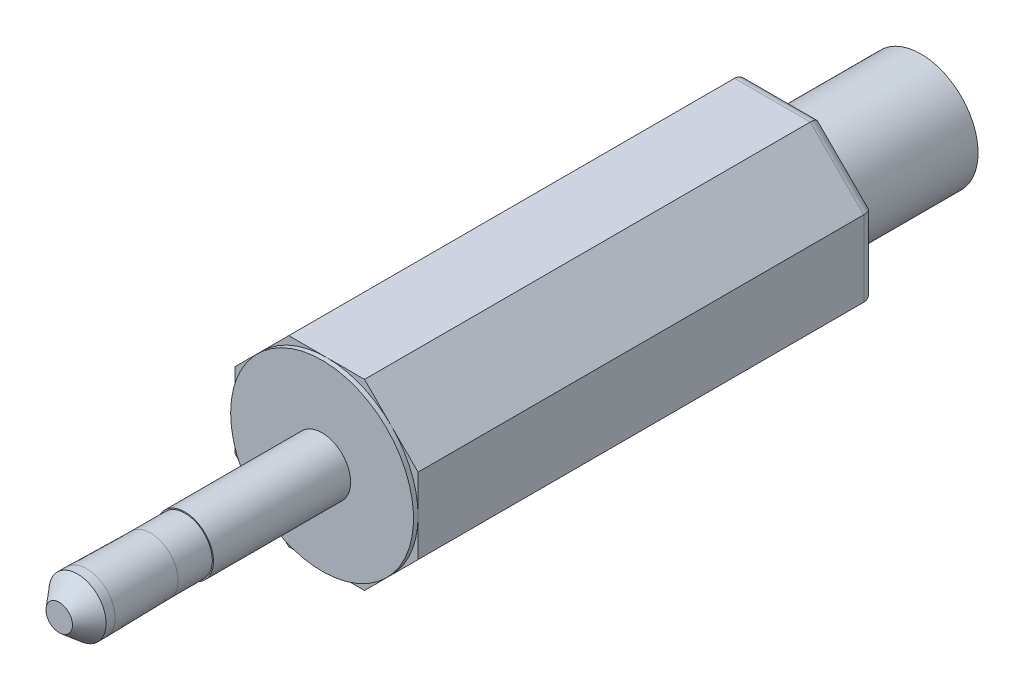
ISO-10303-21;
HEADER;
FILE_DESCRIPTION(('STEP AP214'),'2;1');
FILE_NAME('part.step','',(''),(''),'','','');
FILE_SCHEMA(('AUTOMOTIVE_DESIGN { 1 0 10303 214 1 1 1 1 }'));
ENDSEC;
DATA;
#1=APPLICATION_CONTEXT('core data for automotive mechanical design processes');
#2=APPLICATION_PROTOCOL_DEFINITION('international standard','automotive_design',2000,#1);
#3=PRODUCT_CONTEXT('',#1,'mechanical');
#4=PRODUCT('Part','Part','',(#3));
#5=PRODUCT_RELATED_PRODUCT_CATEGORY('part','',(#4));
#6=PRODUCT_DEFINITION_FORMATION('','',#4);
#7=PRODUCT_DEFINITION_CONTEXT('part definition',#1,'design');
#8=PRODUCT_DEFINITION('design','',#6,#7);
#9=PRODUCT_DEFINITION_SHAPE('','',#8);
#10=(LENGTH_UNIT() NAMED_UNIT(*) SI_UNIT(.MILLI.,.METRE.));
#11=(NAMED_UNIT(*) PLANE_ANGLE_UNIT() SI_UNIT($,.RADIAN.));
#12=(NAMED_UNIT(*) SI_UNIT($,.STERADIAN.) SOLID_ANGLE_UNIT());
#13=UNCERTAINTY_MEASURE_WITH_UNIT(LENGTH_MEASURE(1.E-05),#10,'distance_accuracy_value','');
#14=(GEOMETRIC_REPRESENTATION_CONTEXT(3) GLOBAL_UNCERTAINTY_ASSIGNED_CONTEXT((#13)) GLOBAL_UNIT_ASSIGNED_CONTEXT((#10,
#11,#12)) REPRESENTATION_CONTEXT('',''));
#15=CARTESIAN_POINT('',(0.,0.,0.));
#16=DIRECTION('',(0.,0.,1.));
#17=DIRECTION('',(1.,0.,0.));
#18=AXIS2_PLACEMENT_3D('',#15,#16,#17);
#19=CARTESIAN_POINT('',(-5.65685424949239,0.,-20.2));
#20=DIRECTION('',(0.,0.,-1.));
#21=DIRECTION('',(-1.,0.,0.));
#22=AXIS2_PLACEMENT_3D('',#19,#20,#21);
#23=PLANE('',#22);
#24=DIRECTION('',(1.,0.,0.));
#25=VECTOR('',#24,1.);
#26=CARTESIAN_POINT('',(1.65685424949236,3.50000000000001,-20.2));
#27=LINE('',#26,#25);
#28=CARTESIAN_POINT('',(-1.44974746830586,3.49999999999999,-20.2));
#29=VERTEX_POINT('',#28);
#30=CARTESIAN_POINT('',(1.44974746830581,3.50000000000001,-20.2));
#31=VERTEX_POINT('',#30);
#32=EDGE_CURVE('E470',#29,#31,#27,.T.);
#33=ORIENTED_EDGE('',*,*,#32,.T.);
#34=DIRECTION('',(0.707106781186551,-0.707106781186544,0.));
#35=VECTOR('',#34,1.);
#36=CARTESIAN_POINT('',(3.64644660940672,1.30330085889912,-20.2));
#37=LINE('',#36,#35);
#38=CARTESIAN_POINT('',(3.49999999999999,1.44974746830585,-20.2));
#39=VERTEX_POINT('',#38);
#40=EDGE_CURVE('E472',#31,#39,#37,.T.);
#41=ORIENTED_EDGE('',*,*,#40,.T.);
#42=DIRECTION('',(0.,-1.,0.));
#43=VECTOR('',#42,1.);
#44=CARTESIAN_POINT('',(3.50000000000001,-1.65685424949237,-20.2));
#45=LINE('',#44,#43);
#46=CARTESIAN_POINT('',(3.5,-1.44974746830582,-20.2));
#47=VERTEX_POINT('',#46);
#48=EDGE_CURVE('E466',#39,#47,#45,.T.);
#49=ORIENTED_EDGE('',*,*,#48,.T.);
#50=DIRECTION('',(-0.707106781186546,-0.707106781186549,0.));
#51=VECTOR('',#50,1.);
#52=CARTESIAN_POINT('',(1.30330085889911,-3.64644660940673,-20.2));
#53=LINE('',#52,#51);
#54=CARTESIAN_POINT('',(1.44974746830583,-3.5,-20.2));
#55=VERTEX_POINT('',#54);
#56=EDGE_CURVE('E464',#47,#55,#53,.T.);
#57=ORIENTED_EDGE('',*,*,#56,.T.);
#58=DIRECTION('',(-1.,0.,0.));
#59=VECTOR('',#58,1.);
#60=CARTESIAN_POINT('',(-1.65685424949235,-3.5,-20.2));
#61=LINE('',#60,#59);
#62=CARTESIAN_POINT('',(-1.44974746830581,-3.5,-20.2));
#63=VERTEX_POINT('',#62);
#64=EDGE_CURVE('E462',#55,#63,#61,.T.);
#65=ORIENTED_EDGE('',*,*,#64,.T.);
#66=DIRECTION('',(-0.707106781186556,0.707106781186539,0.));
#67=VECTOR('',#66,1.);
#68=CARTESIAN_POINT('',(-3.64644660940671,-1.30330085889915,-20.2));
#69=LINE('',#68,#67);
#70=CARTESIAN_POINT('',(-3.49999999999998,-1.44974746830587,-20.2));
#71=VERTEX_POINT('',#70);
#72=EDGE_CURVE('E460',#63,#71,#69,.T.);
#73=ORIENTED_EDGE('',*,*,#72,.T.);
#74=DIRECTION('',(0.,1.,0.));
#75=VECTOR('',#74,1.);
#76=CARTESIAN_POINT('',(-3.50000000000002,1.65685424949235,-20.2));
#77=LINE('',#76,#75);
#78=CARTESIAN_POINT('',(-3.50000000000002,1.4497474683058,-20.2));
#79=VERTEX_POINT('',#78);
#80=EDGE_CURVE('E458',#71,#79,#77,.T.);
#81=ORIENTED_EDGE('',*,*,#80,.T.);
#82=DIRECTION('',(0.707106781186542,0.707106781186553,0.));
#83=VECTOR('',#82,1.);
#84=CARTESIAN_POINT('',(-1.30330085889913,3.64644660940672,-20.2));
#85=LINE('',#84,#83);
#86=EDGE_CURVE('E468',#79,#29,#85,.T.);
#87=ORIENTED_EDGE('',*,*,#86,.T.);
#88=EDGE_LOOP('',(#33,#41,#49,#57,#65,#73,#81,#87));
#89=FACE_BOUND('',#88,.T.);
#90=CARTESIAN_POINT('',(0.,0.,-20.2));
#91=DIRECTION('',(0.,0.,-1.));
#92=DIRECTION('',(-1.,0.,0.));
#93=AXIS2_PLACEMENT_3D('',#90,#91,#92);
#94=CIRCLE('',#93,2.5);
#95=CARTESIAN_POINT('',(-2.5,0.,-20.2));
#96=VERTEX_POINT('',#95);
#97=EDGE_CURVE('E321',#96,#96,#94,.T.);
#98=ORIENTED_EDGE('',*,*,#97,.F.);
#99=EDGE_LOOP('',(#98));
#100=FACE_BOUND('',#99,.T.);
#101=ADVANCED_FACE('F30',(#89,#100),#23,.T.);
#102=CARTESIAN_POINT('',(0.,0.,6.));
#103=DIRECTION('',(0.,0.,1.));
#104=DIRECTION('',(1.,0.,0.));
#105=AXIS2_PLACEMENT_3D('',#102,#103,#104);
#106=PLANE('',#105);
#107=CARTESIAN_POINT('',(0.,0.,6.));
#108=DIRECTION('',(0.,0.,1.));
#109=DIRECTION('',(1.,0.,0.));
#110=AXIS2_PLACEMENT_3D('',#107,#108,#109);
#111=CIRCLE('',#110,1.25);
#112=CARTESIAN_POINT('',(1.25,0.,6.));
#113=VERTEX_POINT('',#112);
#114=EDGE_CURVE('E441',#113,#113,#111,.T.);
#115=ORIENTED_EDGE('',*,*,#114,.T.);
#116=EDGE_LOOP('',(#115));
#117=FACE_BOUND('',#116,.T.);
#118=CARTESIAN_POINT('',(0.,0.,6.));
#119=DIRECTION('',(0.,0.,1.));
#120=DIRECTION('',(1.,0.,0.));
#121=AXIS2_PLACEMENT_3D('',#118,#119,#120);
#122=CIRCLE('',#121,1.2);
#123=CARTESIAN_POINT('',(1.2,0.,6.));
#124=VERTEX_POINT('',#123);
#125=EDGE_CURVE('E437',#124,#124,#122,.T.);
#126=ORIENTED_EDGE('',*,*,#125,.F.);
#127=EDGE_LOOP('',(#126));
#128=FACE_BOUND('',#127,.T.);
#129=ADVANCED_FACE('F602',(#117,#128),#106,.T.);
#130=CARTESIAN_POINT('',(0.,0.,6.));
#131=DIRECTION('',(0.,0.,-1.));
#132=DIRECTION('',(-1.,0.,0.));
#133=AXIS2_PLACEMENT_3D('',#130,#131,#132);
#134=CYLINDRICAL_SURFACE('',#133,1.25);
#135=ORIENTED_EDGE('',*,*,#114,.F.);
#136=EDGE_LOOP('',(#135));
#137=FACE_BOUND('',#136,.T.);
#138=CARTESIAN_POINT('',(0.,0.,0.));
#139=DIRECTION('',(0.,0.,-1.));
#140=DIRECTION('',(-1.,0.,0.));
#141=AXIS2_PLACEMENT_3D('',#138,#139,#140);
#142=CIRCLE('',#141,1.25);
#143=CARTESIAN_POINT('',(-1.25,0.,0.));
#144=VERTEX_POINT('',#143);
#145=EDGE_CURVE('E431',#144,#144,#142,.T.);
#146=ORIENTED_EDGE('',*,*,#145,.F.);
#147=EDGE_LOOP('',(#146));
#148=FACE_BOUND('',#147,.T.);
#149=ADVANCED_FACE('F607',(#137,#148),#134,.T.);
#150=CARTESIAN_POINT('',(0.,0.,7.5));
#151=DIRECTION('',(0.,0.,-1.));
#152=DIRECTION('',(-1.,0.,0.));
#153=AXIS2_PLACEMENT_3D('',#150,#151,#152);
#154=CYLINDRICAL_SURFACE('',#153,1.2);
#155=CARTESIAN_POINT('',(0.,0.,7.5));
#156=DIRECTION('',(0.,0.,1.));
#157=DIRECTION('',(1.,0.,0.));
#158=AXIS2_PLACEMENT_3D('',#155,#156,#157);
#159=CIRCLE('',#158,1.2);
#160=CARTESIAN_POINT('',(1.2,0.,7.5));
#161=VERTEX_POINT('',#160);
#162=EDGE_CURVE('E438',#161,#161,#159,.T.);
#163=ORIENTED_EDGE('',*,*,#162,.F.);
#164=EDGE_LOOP('',(#163));
#165=FACE_BOUND('',#164,.T.);
#166=ORIENTED_EDGE('',*,*,#125,.T.);
#167=EDGE_LOOP('',(#166));
#168=FACE_BOUND('',#167,.T.);
#169=ADVANCED_FACE('F653',(#165,#168),#154,.T.);
#170=CARTESIAN_POINT('',(0.,0.,7.5));
#171=DIRECTION('',(0.,0.,1.));
#172=DIRECTION('',(1.,0.,0.));
#173=AXIS2_PLACEMENT_3D('',#170,#171,#172);
#174=PLANE('',#173);
#175=CARTESIAN_POINT('',(0.,0.,7.5));
#176=DIRECTION('',(0.,0.,1.));
#177=DIRECTION('',(1.,0.,0.));
#178=AXIS2_PLACEMENT_3D('',#175,#176,#177);
#179=CIRCLE('',#178,1.20112581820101);
#180=CARTESIAN_POINT('',(1.20112581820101,0.,7.5));
#181=VERTEX_POINT('',#180);
#182=EDGE_CURVE('E449',#181,#181,#179,.F.);
#183=ORIENTED_EDGE('',*,*,#182,.T.);
#184=EDGE_LOOP('',(#183));
#185=FACE_BOUND('',#184,.T.);
#186=ORIENTED_EDGE('',*,*,#162,.T.);
#187=EDGE_LOOP('',(#186));
#188=FACE_BOUND('',#187,.T.);
#189=ADVANCED_FACE('F650',(#185,#188),#174,.F.);
#190=CARTESIAN_POINT('',(0.,0.,11.5));
#191=DIRECTION('',(0.,0.,-1.));
#192=DIRECTION('',(-1.,0.,0.));
#193=AXIS2_PLACEMENT_3D('',#190,#191,#192);
#194=CYLINDRICAL_SURFACE('',#193,1.25);
#195=CARTESIAN_POINT('',(0.,0.,10.7));
#196=DIRECTION('',(0.,0.,1.));
#197=DIRECTION('',(1.,0.,0.));
#198=AXIS2_PLACEMENT_3D('',#195,#196,#197);
#199=CIRCLE('',#198,1.25);
#200=CARTESIAN_POINT('',(1.25,0.,10.7));
#201=VERTEX_POINT('',#200);
#202=EDGE_CURVE('E455',#201,#201,#199,.F.);
#203=ORIENTED_EDGE('',*,*,#202,.T.);
#204=EDGE_LOOP('',(#203));
#205=FACE_BOUND('',#204,.T.);
#206=CARTESIAN_POINT('',(0.,0.,10.2999999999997));
#207=DIRECTION('',(0.,0.,1.));
#208=DIRECTION('',(1.,0.,0.));
#209=AXIS2_PLACEMENT_3D('',#206,#207,#208);
#210=CIRCLE('',#209,1.25);
#211=CARTESIAN_POINT('',(1.25,0.,10.2999999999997));
#212=VERTEX_POINT('',#211);
#213=EDGE_CURVE('E446',#212,#212,#210,.T.);
#214=ORIENTED_EDGE('',*,*,#213,.T.);
#215=EDGE_LOOP('',(#214));
#216=FACE_BOUND('',#215,.T.);
#217=ADVANCED_FACE('F648',(#205,#216),#194,.T.);
#218=CARTESIAN_POINT('',(0.,0.,11.5));
#219=DIRECTION('',(0.,0.,1.));
#220=DIRECTION('',(1.,0.,0.));
#221=AXIS2_PLACEMENT_3D('',#218,#219,#220);
#222=PLANE('',#221);
#223=CARTESIAN_POINT('',(0.,0.,11.5));
#224=DIRECTION('',(0.,0.,1.));
#225=DIRECTION('',(1.,0.,0.));
#226=AXIS2_PLACEMENT_3D('',#223,#224,#225);
#227=CIRCLE('',#226,0.578720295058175);
#228=CARTESIAN_POINT('',(0.578720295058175,0.,11.5));
#229=VERTEX_POINT('',#228);
#230=EDGE_CURVE('E452',#229,#229,#227,.T.);
#231=ORIENTED_EDGE('',*,*,#230,.T.);
#232=EDGE_LOOP('',(#231));
#233=FACE_BOUND('',#232,.T.);
#234=ADVANCED_FACE('F644',(#233),#222,.T.);
#235=CARTESIAN_POINT('',(0.,0.,10.2999999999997));
#236=DIRECTION('',(0.,0.,1.));
#237=DIRECTION('',(1.,0.,0.));
#238=AXIS2_PLACEMENT_3D('',#235,#236,#237);
#239=CONICAL_SURFACE('',#238,1.25,0.0174532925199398);
#240=ORIENTED_EDGE('',*,*,#182,.F.);
#241=EDGE_LOOP('',(#240));
#242=FACE_BOUND('',#241,.T.);
#243=ORIENTED_EDGE('',*,*,#213,.F.);
#244=EDGE_LOOP('',(#243));
#245=FACE_BOUND('',#244,.T.);
#246=ADVANCED_FACE('F647',(#242,#245),#239,.T.);
#247=CARTESIAN_POINT('',(0.,0.,11.5));
#248=DIRECTION('',(0.,0.,-1.));
#249=DIRECTION('',(-1.,0.,0.));
#250=AXIS2_PLACEMENT_3D('',#247,#248,#249);
#251=CONICAL_SURFACE('',#250,0.578720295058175,0.69813170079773);
#252=ORIENTED_EDGE('',*,*,#202,.F.);
#253=EDGE_LOOP('',(#252));
#254=FACE_BOUND('',#253,.T.);
#255=ORIENTED_EDGE('',*,*,#230,.F.);
#256=EDGE_LOOP('',(#255));
#257=FACE_BOUND('',#256,.T.);
#258=ADVANCED_FACE('F639',(#254,#257),#251,.T.);
#259=CARTESIAN_POINT('',(0.,0.,0.));
#260=DIRECTION('',(0.,0.,-1.));
#261=DIRECTION('',(-1.,0.,0.));
#262=AXIS2_PLACEMENT_3D('',#259,#260,#261);
#263=PLANE('',#262);
#264=CARTESIAN_POINT('',(0.,0.,0.));
#265=DIRECTION('',(0.,0.,-1.));
#266=DIRECTION('',(-1.,0.,0.));
#267=AXIS2_PLACEMENT_3D('',#264,#265,#266);
#268=CIRCLE('',#267,4.);
#269=CARTESIAN_POINT('',(-4.,0.,0.));
#270=VERTEX_POINT('',#269);
#271=EDGE_CURVE('E432',#270,#270,#268,.T.);
#272=ORIENTED_EDGE('',*,*,#271,.F.);
#273=EDGE_LOOP('',(#272));
#274=FACE_BOUND('',#273,.T.);
#275=ORIENTED_EDGE('',*,*,#145,.T.);
#276=EDGE_LOOP('',(#275));
#277=FACE_BOUND('',#276,.T.);
#278=ADVANCED_FACE('F636',(#274,#277),#263,.F.);
#279=CARTESIAN_POINT('',(0.,0.,-0.2));
#280=DIRECTION('',(0.,0.,1.));
#281=DIRECTION('',(1.,0.,0.));
#282=AXIS2_PLACEMENT_3D('',#279,#280,#281);
#283=CYLINDRICAL_SURFACE('',#282,4.);
#284=CARTESIAN_POINT('',(0.,0.,-0.2));
#285=DIRECTION('',(0.,0.,-1.));
#286=DIRECTION('',(-1.,0.,0.));
#287=AXIS2_PLACEMENT_3D('',#284,#285,#286);
#288=CIRCLE('',#287,4.);
#289=CARTESIAN_POINT('',(-4.,0.,-0.2));
#290=VERTEX_POINT('',#289);
#291=CARTESIAN_POINT('',(-2.82842712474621,2.82842712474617,-0.2));
#292=VERTEX_POINT('',#291);
#293=EDGE_CURVE('E428',#290,#292,#288,.T.);
#294=ORIENTED_EDGE('',*,*,#293,.F.);
#295=CARTESIAN_POINT('',(0.,0.,-0.2));
#296=DIRECTION('',(0.,0.,-1.));
#297=DIRECTION('',(-1.,0.,0.));
#298=AXIS2_PLACEMENT_3D('',#295,#296,#297);
#299=CIRCLE('',#298,4.);
#300=CARTESIAN_POINT('',(-2.82842712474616,-2.82842712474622,-0.2));
#301=VERTEX_POINT('',#300);
#302=EDGE_CURVE('E423',#301,#290,#299,.T.);
#303=ORIENTED_EDGE('',*,*,#302,.F.);
#304=CARTESIAN_POINT('',(0.,-4.,-0.2));
#305=VERTEX_POINT('',#304);
#306=EDGE_CURVE('E426',#305,#301,#299,.T.);
#307=ORIENTED_EDGE('',*,*,#306,.F.);
#308=CARTESIAN_POINT('',(2.8284271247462,-2.82842712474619,-0.2));
#309=VERTEX_POINT('',#308);
#310=EDGE_CURVE('E535',#309,#305,#299,.T.);
#311=ORIENTED_EDGE('',*,*,#310,.F.);
#312=CARTESIAN_POINT('',(4.,0.,-0.2));
#313=VERTEX_POINT('',#312);
#314=EDGE_CURVE('E1235',#313,#309,#299,.T.);
#315=ORIENTED_EDGE('',*,*,#314,.F.);
#316=CARTESIAN_POINT('',(2.82842712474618,2.8284271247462,-0.2));
#317=VERTEX_POINT('',#316);
#318=EDGE_CURVE('E1237',#317,#313,#299,.T.);
#319=ORIENTED_EDGE('',*,*,#318,.F.);
#320=CARTESIAN_POINT('',(0.,4.,-0.2));
#321=VERTEX_POINT('',#320);
#322=EDGE_CURVE('E1239',#321,#317,#299,.T.);
#323=ORIENTED_EDGE('',*,*,#322,.F.);
#324=EDGE_CURVE('E427',#292,#321,#299,.T.);
#325=ORIENTED_EDGE('',*,*,#324,.F.);
#326=EDGE_LOOP('',(#294,#303,#307,#311,#315,#319,#323,#325));
#327=FACE_BOUND('',#326,.T.);
#328=ORIENTED_EDGE('',*,*,#271,.T.);
#329=EDGE_LOOP('',(#328));
#330=FACE_BOUND('',#329,.T.);
#331=ADVANCED_FACE('F617',(#327,#330),#283,.T.);
#332=CARTESIAN_POINT('',(-5.65685424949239,0.,-0.2));
#333=DIRECTION('',(0.,0.,-1.));
#334=DIRECTION('',(-1.,0.,0.));
#335=AXIS2_PLACEMENT_3D('',#332,#333,#334);
#336=PLANE('',#335);
#337=DIRECTION('',(0.,1.,0.));
#338=VECTOR('',#337,1.);
#339=CARTESIAN_POINT('',(-3.99999999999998,-1.65685424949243,-0.2));
#340=LINE('',#339,#338);
#341=CARTESIAN_POINT('',(-4.00000000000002,1.65685424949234,-0.2));
#342=VERTEX_POINT('',#341);
#343=EDGE_CURVE('E379',#290,#342,#340,.T.);
#344=ORIENTED_EDGE('',*,*,#343,.F.);
#345=ORIENTED_EDGE('',*,*,#293,.T.);
#346=DIRECTION('',(0.707106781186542,0.707106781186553,0.));
#347=VECTOR('',#346,1.);
#348=CARTESIAN_POINT('',(-4.00000000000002,1.65685424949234,-0.2));
#349=LINE('',#348,#347);
#350=EDGE_CURVE('E384',#342,#292,#349,.T.);
#351=ORIENTED_EDGE('',*,*,#350,.F.);
#352=EDGE_LOOP('',(#344,#345,#351));
#353=FACE_BOUND('',#352,.T.);
#354=ADVANCED_FACE('F552',(#353),#336,.F.);
#355=CARTESIAN_POINT('',(-1.65685424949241,3.99999999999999,-0.2));
#356=VERTEX_POINT('',#355);
#357=EDGE_CURVE('E383',#292,#356,#349,.T.);
#358=ORIENTED_EDGE('',*,*,#357,.F.);
#359=ORIENTED_EDGE('',*,*,#324,.T.);
#360=DIRECTION('',(1.,0.,0.));
#361=VECTOR('',#360,1.);
#362=CARTESIAN_POINT('',(-1.65685424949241,3.99999999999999,-0.2));
#363=LINE('',#362,#361);
#364=EDGE_CURVE('E388',#356,#321,#363,.T.);
#365=ORIENTED_EDGE('',*,*,#364,.F.);
#366=EDGE_LOOP('',(#358,#359,#365));
#367=FACE_BOUND('',#366,.T.);
#368=ADVANCED_FACE('F616',(#367),#336,.F.);
#369=CARTESIAN_POINT('',(1.65685424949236,4.00000000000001,-0.2));
#370=VERTEX_POINT('',#369);
#371=EDGE_CURVE('E387',#321,#370,#363,.T.);
#372=ORIENTED_EDGE('',*,*,#371,.F.);
#373=ORIENTED_EDGE('',*,*,#322,.T.);
#374=DIRECTION('',(0.707106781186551,-0.707106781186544,0.));
#375=VECTOR('',#374,1.);
#376=CARTESIAN_POINT('',(1.65685424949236,4.00000000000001,-0.2));
#377=LINE('',#376,#375);
#378=EDGE_CURVE('E392',#370,#317,#377,.T.);
#379=ORIENTED_EDGE('',*,*,#378,.F.);
#380=EDGE_LOOP('',(#372,#373,#379));
#381=FACE_BOUND('',#380,.T.);
#382=ADVANCED_FACE('F697',(#381),#336,.F.);
#383=CARTESIAN_POINT('',(3.99999999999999,1.6568542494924,-0.2));
#384=VERTEX_POINT('',#383);
#385=EDGE_CURVE('E391',#317,#384,#377,.T.);
#386=ORIENTED_EDGE('',*,*,#385,.F.);
#387=ORIENTED_EDGE('',*,*,#318,.T.);
#388=DIRECTION('',(0.,-1.,0.));
#389=VECTOR('',#388,1.);
#390=CARTESIAN_POINT('',(3.99999999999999,1.6568542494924,-0.2));
#391=LINE('',#390,#389);
#392=EDGE_CURVE('E396',#384,#313,#391,.T.);
#393=ORIENTED_EDGE('',*,*,#392,.F.);
#394=EDGE_LOOP('',(#386,#387,#393));
#395=FACE_BOUND('',#394,.T.);
#396=ADVANCED_FACE('F704',(#395),#336,.F.);
#397=CARTESIAN_POINT('',(4.00000000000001,-1.65685424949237,-0.2));
#398=VERTEX_POINT('',#397);
#399=EDGE_CURVE('E395',#313,#398,#391,.T.);
#400=ORIENTED_EDGE('',*,*,#399,.F.);
#401=ORIENTED_EDGE('',*,*,#314,.T.);
#402=DIRECTION('',(-0.707106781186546,-0.707106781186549,0.));
#403=VECTOR('',#402,1.);
#404=CARTESIAN_POINT('',(4.00000000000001,-1.65685424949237,-0.2));
#405=LINE('',#404,#403);
#406=EDGE_CURVE('E400',#398,#309,#405,.T.);
#407=ORIENTED_EDGE('',*,*,#406,.F.);
#408=EDGE_LOOP('',(#400,#401,#407));
#409=FACE_BOUND('',#408,.T.);
#410=ADVANCED_FACE('F711',(#409),#336,.F.);
#411=CARTESIAN_POINT('',(1.65685424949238,-4.,-0.2));
#412=VERTEX_POINT('',#411);
#413=EDGE_CURVE('E399',#309,#412,#405,.T.);
#414=ORIENTED_EDGE('',*,*,#413,.F.);
#415=ORIENTED_EDGE('',*,*,#310,.T.);
#416=DIRECTION('',(-1.,0.,0.));
#417=VECTOR('',#416,1.);
#418=CARTESIAN_POINT('',(1.65685424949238,-4.,-0.2));
#419=LINE('',#418,#417);
#420=EDGE_CURVE('E404',#412,#305,#419,.T.);
#421=ORIENTED_EDGE('',*,*,#420,.F.);
#422=EDGE_LOOP('',(#414,#415,#421));
#423=FACE_BOUND('',#422,.T.);
#424=ADVANCED_FACE('F534',(#423),#336,.F.);
#425=CARTESIAN_POINT('',(-1.65685424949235,-4.,-0.2));
#426=VERTEX_POINT('',#425);
#427=EDGE_CURVE('E403',#305,#426,#419,.T.);
#428=ORIENTED_EDGE('',*,*,#427,.F.);
#429=ORIENTED_EDGE('',*,*,#306,.T.);
#430=DIRECTION('',(-0.707106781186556,0.707106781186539,0.));
#431=VECTOR('',#430,1.);
#432=CARTESIAN_POINT('',(-1.65685424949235,-4.,-0.2));
#433=LINE('',#432,#431);
#434=EDGE_CURVE('E376',#426,#301,#433,.T.);
#435=ORIENTED_EDGE('',*,*,#434,.F.);
#436=EDGE_LOOP('',(#428,#429,#435));
#437=FACE_BOUND('',#436,.T.);
#438=ADVANCED_FACE('F540',(#437),#336,.F.);
#439=CARTESIAN_POINT('',(-3.99999999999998,-1.65685424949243,-0.2));
#440=VERTEX_POINT('',#439);
#441=EDGE_CURVE('E373',#301,#440,#433,.T.);
#442=ORIENTED_EDGE('',*,*,#441,.F.);
#443=ORIENTED_EDGE('',*,*,#302,.T.);
#444=EDGE_CURVE('E380',#440,#290,#340,.T.);
#445=ORIENTED_EDGE('',*,*,#444,.F.);
#446=EDGE_LOOP('',(#442,#443,#445));
#447=FACE_BOUND('',#446,.T.);
#448=ADVANCED_FACE('F546',(#447),#336,.F.);
#449=CARTESIAN_POINT('',(-1.65685424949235,-4.,-20.2));
#450=DIRECTION('',(0.707106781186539,0.707106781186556,0.));
#451=DIRECTION('',(-0.707106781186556,0.707106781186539,0.));
#452=AXIS2_PLACEMENT_3D('',#449,#450,#451);
#453=PLANE('',#452);
#454=DIRECTION('',(0.,0.,1.));
#455=VECTOR('',#454,1.);
#456=CARTESIAN_POINT('',(-3.99999999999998,-1.65685424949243,-20.2));
#457=LINE('',#456,#455);
#458=CARTESIAN_POINT('',(-3.99999999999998,-1.65685424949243,-19.7));
#459=VERTEX_POINT('',#458);
#460=EDGE_CURVE('E421',#459,#440,#457,.T.);
#461=ORIENTED_EDGE('',*,*,#460,.F.);
#462=DIRECTION('',(-0.707106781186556,0.707106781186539,0.));
#463=VECTOR('',#462,1.);
#464=CARTESIAN_POINT('',(-1.65685424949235,-4.,-19.7));
#465=LINE('',#464,#463);
#466=CARTESIAN_POINT('',(-1.65685424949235,-4.,-19.7));
#467=VERTEX_POINT('',#466);
#468=EDGE_CURVE('E39',#459,#467,#465,.F.);
#469=ORIENTED_EDGE('',*,*,#468,.T.);
#470=DIRECTION('',(0.,0.,1.));
#471=VECTOR('',#470,1.);
#472=CARTESIAN_POINT('',(-1.65685424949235,-4.,-20.2));
#473=LINE('',#472,#471);
#474=EDGE_CURVE('E407',#467,#426,#473,.T.);
#475=ORIENTED_EDGE('',*,*,#474,.T.);
#476=ORIENTED_EDGE('',*,*,#434,.T.);
#477=ORIENTED_EDGE('',*,*,#441,.T.);
#478=EDGE_LOOP('',(#461,#469,#475,#476,#477));
#479=FACE_BOUND('',#478,.T.);
#480=ADVANCED_FACE('F543',(#479),#453,.F.);
#481=CARTESIAN_POINT('',(-3.99999999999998,-1.65685424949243,-20.2));
#482=DIRECTION('',(1.,0.,0.));
#483=DIRECTION('',(0.,1.,0.));
#484=AXIS2_PLACEMENT_3D('',#481,#482,#483);
#485=PLANE('',#484);
#486=DIRECTION('',(0.,0.,1.));
#487=VECTOR('',#486,1.);
#488=CARTESIAN_POINT('',(-4.00000000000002,1.65685424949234,-20.2));
#489=LINE('',#488,#487);
#490=CARTESIAN_POINT('',(-4.00000000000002,1.65685424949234,-19.7));
#491=VERTEX_POINT('',#490);
#492=EDGE_CURVE('E419',#491,#342,#489,.T.);
#493=ORIENTED_EDGE('',*,*,#492,.F.);
#494=DIRECTION('',(0.,1.,0.));
#495=VECTOR('',#494,1.);
#496=CARTESIAN_POINT('',(-3.99999999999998,-1.65685424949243,-19.7));
#497=LINE('',#496,#495);
#498=EDGE_CURVE('E11',#491,#459,#497,.F.);
#499=ORIENTED_EDGE('',*,*,#498,.T.);
#500=ORIENTED_EDGE('',*,*,#460,.T.);
#501=ORIENTED_EDGE('',*,*,#444,.T.);
#502=ORIENTED_EDGE('',*,*,#343,.T.);
#503=EDGE_LOOP('',(#493,#499,#500,#501,#502));
#504=FACE_BOUND('',#503,.T.);
#505=ADVANCED_FACE('F549',(#504),#485,.F.);
#506=CARTESIAN_POINT('',(-4.00000000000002,1.65685424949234,-20.2));
#507=DIRECTION('',(0.707106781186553,-0.707106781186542,0.));
#508=DIRECTION('',(0.707106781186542,0.707106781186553,0.));
#509=AXIS2_PLACEMENT_3D('',#506,#507,#508);
#510=PLANE('',#509);
#511=DIRECTION('',(0.,0.,1.));
#512=VECTOR('',#511,1.);
#513=CARTESIAN_POINT('',(-1.65685424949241,3.99999999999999,-20.2));
#514=LINE('',#513,#512);
#515=CARTESIAN_POINT('',(-1.65685424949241,3.99999999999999,-19.7));
#516=VERTEX_POINT('',#515);
#517=EDGE_CURVE('E417',#516,#356,#514,.T.);
#518=ORIENTED_EDGE('',*,*,#517,.F.);
#519=DIRECTION('',(0.707106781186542,0.707106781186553,0.));
#520=VECTOR('',#519,1.);
#521=CARTESIAN_POINT('',(-4.00000000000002,1.65685424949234,-19.7));
#522=LINE('',#521,#520);
#523=EDGE_CURVE('E480',#516,#491,#522,.F.);
#524=ORIENTED_EDGE('',*,*,#523,.T.);
#525=ORIENTED_EDGE('',*,*,#492,.T.);
#526=ORIENTED_EDGE('',*,*,#350,.T.);
#527=ORIENTED_EDGE('',*,*,#357,.T.);
#528=EDGE_LOOP('',(#518,#524,#525,#526,#527));
#529=FACE_BOUND('',#528,.T.);
#530=ADVANCED_FACE('F557',(#529),#510,.F.);
#531=CARTESIAN_POINT('',(-1.65685424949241,3.99999999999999,-20.2));
#532=DIRECTION('',(0.,-1.,0.));
#533=DIRECTION('',(1.,0.,0.));
#534=AXIS2_PLACEMENT_3D('',#531,#532,#533);
#535=PLANE('',#534);
#536=DIRECTION('',(0.,0.,1.));
#537=VECTOR('',#536,1.);
#538=CARTESIAN_POINT('',(1.65685424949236,4.00000000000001,-20.2));
#539=LINE('',#538,#537);
#540=CARTESIAN_POINT('',(1.65685424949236,4.00000000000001,-19.7));
#541=VERTEX_POINT('',#540);
#542=EDGE_CURVE('E415',#541,#370,#539,.T.);
#543=ORIENTED_EDGE('',*,*,#542,.F.);
#544=DIRECTION('',(1.,0.,0.));
#545=VECTOR('',#544,1.);
#546=CARTESIAN_POINT('',(-1.65685424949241,3.99999999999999,-19.7));
#547=LINE('',#546,#545);
#548=EDGE_CURVE('E478',#541,#516,#547,.F.);
#549=ORIENTED_EDGE('',*,*,#548,.T.);
#550=ORIENTED_EDGE('',*,*,#517,.T.);
#551=ORIENTED_EDGE('',*,*,#364,.T.);
#552=ORIENTED_EDGE('',*,*,#371,.T.);
#553=EDGE_LOOP('',(#543,#549,#550,#551,#552));
#554=FACE_BOUND('',#553,.T.);
#555=ADVANCED_FACE('F626',(#554),#535,.F.);
#556=CARTESIAN_POINT('',(1.65685424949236,4.00000000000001,-20.2));
#557=DIRECTION('',(-0.707106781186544,-0.707106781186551,0.));
#558=DIRECTION('',(0.707106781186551,-0.707106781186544,0.));
#559=AXIS2_PLACEMENT_3D('',#556,#557,#558);
#560=PLANE('',#559);
#561=DIRECTION('',(0.,0.,1.));
#562=VECTOR('',#561,1.);
#563=CARTESIAN_POINT('',(3.99999999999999,1.6568542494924,-20.2));
#564=LINE('',#563,#562);
#565=CARTESIAN_POINT('',(3.99999999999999,1.6568542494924,-19.7));
#566=VERTEX_POINT('',#565);
#567=EDGE_CURVE('E413',#566,#384,#564,.T.);
#568=ORIENTED_EDGE('',*,*,#567,.F.);
#569=DIRECTION('',(0.707106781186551,-0.707106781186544,0.));
#570=VECTOR('',#569,1.);
#571=CARTESIAN_POINT('',(1.65685424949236,4.00000000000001,-19.7));
#572=LINE('',#571,#570);
#573=EDGE_CURVE('E475',#566,#541,#572,.F.);
#574=ORIENTED_EDGE('',*,*,#573,.T.);
#575=ORIENTED_EDGE('',*,*,#542,.T.);
#576=ORIENTED_EDGE('',*,*,#378,.T.);
#577=ORIENTED_EDGE('',*,*,#385,.T.);
#578=EDGE_LOOP('',(#568,#574,#575,#576,#577));
#579=FACE_BOUND('',#578,.T.);
#580=ADVANCED_FACE('F588',(#579),#560,.F.);
#581=CARTESIAN_POINT('',(3.99999999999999,1.6568542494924,-20.2));
#582=DIRECTION('',(-1.,0.,0.));
#583=DIRECTION('',(0.,-1.,0.));
#584=AXIS2_PLACEMENT_3D('',#581,#582,#583);
#585=PLANE('',#584);
#586=DIRECTION('',(0.,0.,1.));
#587=VECTOR('',#586,1.);
#588=CARTESIAN_POINT('',(4.00000000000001,-1.65685424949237,-20.2));
#589=LINE('',#588,#587);
#590=CARTESIAN_POINT('',(4.00000000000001,-1.65685424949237,-19.7));
#591=VERTEX_POINT('',#590);
#592=EDGE_CURVE('E411',#591,#398,#589,.T.);
#593=ORIENTED_EDGE('',*,*,#592,.F.);
#594=DIRECTION('',(0.,-1.,0.));
#595=VECTOR('',#594,1.);
#596=CARTESIAN_POINT('',(3.99999999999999,1.6568542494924,-19.7));
#597=LINE('',#596,#595);
#598=EDGE_CURVE('E482',#591,#566,#597,.F.);
#599=ORIENTED_EDGE('',*,*,#598,.T.);
#600=ORIENTED_EDGE('',*,*,#567,.T.);
#601=ORIENTED_EDGE('',*,*,#392,.T.);
#602=ORIENTED_EDGE('',*,*,#399,.T.);
#603=EDGE_LOOP('',(#593,#599,#600,#601,#602));
#604=FACE_BOUND('',#603,.T.);
#605=ADVANCED_FACE('F583',(#604),#585,.F.);
#606=CARTESIAN_POINT('',(4.00000000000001,-1.65685424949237,-20.2));
#607=DIRECTION('',(-0.707106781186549,0.707106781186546,0.));
#608=DIRECTION('',(-0.707106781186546,-0.707106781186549,0.));
#609=AXIS2_PLACEMENT_3D('',#606,#607,#608);
#610=PLANE('',#609);
#611=DIRECTION('',(0.,0.,1.));
#612=VECTOR('',#611,1.);
#613=CARTESIAN_POINT('',(1.65685424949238,-4.,-20.2));
#614=LINE('',#613,#612);
#615=CARTESIAN_POINT('',(1.65685424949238,-4.,-19.7));
#616=VERTEX_POINT('',#615);
#617=EDGE_CURVE('E409',#616,#412,#614,.T.);
#618=ORIENTED_EDGE('',*,*,#617,.F.);
#619=DIRECTION('',(-0.707106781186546,-0.707106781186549,0.));
#620=VECTOR('',#619,1.);
#621=CARTESIAN_POINT('',(4.00000000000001,-1.65685424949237,-19.7));
#622=LINE('',#621,#620);
#623=EDGE_CURVE('E484',#616,#591,#622,.F.);
#624=ORIENTED_EDGE('',*,*,#623,.T.);
#625=ORIENTED_EDGE('',*,*,#592,.T.);
#626=ORIENTED_EDGE('',*,*,#406,.T.);
#627=ORIENTED_EDGE('',*,*,#413,.T.);
#628=EDGE_LOOP('',(#618,#624,#625,#626,#627));
#629=FACE_BOUND('',#628,.T.);
#630=ADVANCED_FACE('F527',(#629),#610,.F.);
#631=CARTESIAN_POINT('',(1.65685424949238,-4.,-20.2));
#632=DIRECTION('',(0.,1.,0.));
#633=DIRECTION('',(0.,0.,1.));
#634=AXIS2_PLACEMENT_3D('',#631,#632,#633);
#635=PLANE('',#634);
#636=ORIENTED_EDGE('',*,*,#474,.F.);
#637=DIRECTION('',(-1.,0.,0.));
#638=VECTOR('',#637,1.);
#639=CARTESIAN_POINT('',(1.65685424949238,-4.,-19.7));
#640=LINE('',#639,#638);
#641=EDGE_CURVE('E486',#467,#616,#640,.F.);
#642=ORIENTED_EDGE('',*,*,#641,.T.);
#643=ORIENTED_EDGE('',*,*,#617,.T.);
#644=ORIENTED_EDGE('',*,*,#420,.T.);
#645=ORIENTED_EDGE('',*,*,#427,.T.);
#646=EDGE_LOOP('',(#636,#642,#643,#644,#645));
#647=FACE_BOUND('',#646,.T.);
#648=ADVANCED_FACE('F523',(#647),#635,.F.);
#649=CARTESIAN_POINT('',(0.,0.,-26.2));
#650=DIRECTION('',(0.,0.,1.));
#651=DIRECTION('',(1.,0.,0.));
#652=AXIS2_PLACEMENT_3D('',#649,#650,#651);
#653=CYLINDRICAL_SURFACE('',#652,2.5);
#654=CARTESIAN_POINT('',(0.,0.,-26.2));
#655=DIRECTION('',(0.,0.,-1.));
#656=DIRECTION('',(-1.,0.,0.));
#657=AXIS2_PLACEMENT_3D('',#654,#655,#656);
#658=CIRCLE('',#657,2.5);
#659=CARTESIAN_POINT('',(-2.5,0.,-26.2));
#660=VERTEX_POINT('',#659);
#661=EDGE_CURVE('E370',#660,#660,#658,.T.);
#662=ORIENTED_EDGE('',*,*,#661,.F.);
#663=EDGE_LOOP('',(#662));
#664=FACE_BOUND('',#663,.T.);
#665=ORIENTED_EDGE('',*,*,#97,.T.);
#666=EDGE_LOOP('',(#665));
#667=FACE_BOUND('',#666,.T.);
#668=ADVANCED_FACE('F612',(#664,#667),#653,.T.);
#669=CARTESIAN_POINT('',(0.,0.,-26.2));
#670=DIRECTION('',(0.,0.,-1.));
#671=DIRECTION('',(-1.,0.,0.));
#672=AXIS2_PLACEMENT_3D('',#669,#670,#671);
#673=PLANE('',#672);
#674=CARTESIAN_POINT('',(0.,0.,-26.2));
#675=DIRECTION('',(0.,0.,-1.));
#676=DIRECTION('',(-1.,0.,0.));
#677=AXIS2_PLACEMENT_3D('',#674,#675,#676);
#678=CIRCLE('',#677,2.);
#679=CARTESIAN_POINT('',(-2.,0.,-26.2));
#680=VERTEX_POINT('',#679);
#681=EDGE_CURVE('E261',#680,#680,#678,.T.);
#682=ORIENTED_EDGE('',*,*,#681,.F.);
#683=EDGE_LOOP('',(#682));
#684=FACE_BOUND('',#683,.T.);
#685=ORIENTED_EDGE('',*,*,#661,.T.);
#686=EDGE_LOOP('',(#685));
#687=FACE_BOUND('',#686,.T.);
#688=ADVANCED_FACE('F772',(#684,#687),#673,.T.);
#689=CARTESIAN_POINT('',(-5.65685424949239,0.,-19.7));
#690=DIRECTION('',(0.,0.,-1.));
#691=DIRECTION('',(-1.,0.,0.));
#692=AXIS2_PLACEMENT_3D('',#689,#690,#691);
#693=PLANE('',#692);
#694=DIRECTION('',(-0.707106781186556,0.707106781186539,0.));
#695=VECTOR('',#694,1.);
#696=CARTESIAN_POINT('',(-1.30330085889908,-3.64644660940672,-19.7));
#697=LINE('',#696,#695);
#698=CARTESIAN_POINT('',(-1.44974746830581,-3.5,-19.7));
#699=VERTEX_POINT('',#698);
#700=CARTESIAN_POINT('',(-3.49999999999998,-1.44974746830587,-19.7));
#701=VERTEX_POINT('',#700);
#702=EDGE_CURVE('E229',#699,#701,#697,.T.);
#703=ORIENTED_EDGE('',*,*,#702,.F.);
#704=DIRECTION('',(-1.,0.,0.));
#705=VECTOR('',#704,1.);
#706=CARTESIAN_POINT('',(1.65685424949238,-3.5,-19.7));
#707=LINE('',#706,#705);
#708=CARTESIAN_POINT('',(1.44974746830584,-3.5,-19.7));
#709=VERTEX_POINT('',#708);
#710=EDGE_CURVE('E255',#709,#699,#707,.T.);
#711=ORIENTED_EDGE('',*,*,#710,.F.);
#712=DIRECTION('',(-0.707106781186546,-0.707106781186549,0.));
#713=VECTOR('',#712,1.);
#714=CARTESIAN_POINT('',(3.64644660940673,-1.3033008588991,-19.7));
#715=LINE('',#714,#713);
#716=CARTESIAN_POINT('',(3.5,-1.44974746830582,-19.7));
#717=VERTEX_POINT('',#716);
#718=EDGE_CURVE('E253',#717,#709,#715,.T.);
#719=ORIENTED_EDGE('',*,*,#718,.F.);
#720=DIRECTION('',(0.,-1.,0.));
#721=VECTOR('',#720,1.);
#722=CARTESIAN_POINT('',(3.49999999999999,1.6568542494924,-19.7));
#723=LINE('',#722,#721);
#724=CARTESIAN_POINT('',(3.49999999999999,1.44974746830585,-19.7));
#725=VERTEX_POINT('',#724);
#726=EDGE_CURVE('E251',#725,#717,#723,.T.);
#727=ORIENTED_EDGE('',*,*,#726,.F.);
#728=DIRECTION('',(0.707106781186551,-0.707106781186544,0.));
#729=VECTOR('',#728,1.);
#730=CARTESIAN_POINT('',(1.30330085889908,3.64644660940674,-19.7));
#731=LINE('',#730,#729);
#732=CARTESIAN_POINT('',(1.44974746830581,3.50000000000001,-19.7));
#733=VERTEX_POINT('',#732);
#734=EDGE_CURVE('E246',#733,#725,#731,.T.);
#735=ORIENTED_EDGE('',*,*,#734,.F.);
#736=DIRECTION('',(1.,0.,0.));
#737=VECTOR('',#736,1.);
#738=CARTESIAN_POINT('',(-1.65685424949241,3.49999999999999,-19.7));
#739=LINE('',#738,#737);
#740=CARTESIAN_POINT('',(-1.44974746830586,3.49999999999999,-19.7));
#741=VERTEX_POINT('',#740);
#742=EDGE_CURVE('E244',#741,#733,#739,.T.);
#743=ORIENTED_EDGE('',*,*,#742,.F.);
#744=DIRECTION('',(0.707106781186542,0.707106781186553,0.));
#745=VECTOR('',#744,1.);
#746=CARTESIAN_POINT('',(-3.64644660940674,1.30330085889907,-19.7));
#747=LINE('',#746,#745);
#748=CARTESIAN_POINT('',(-3.50000000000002,1.4497474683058,-19.7));
#749=VERTEX_POINT('',#748);
#750=EDGE_CURVE('E228',#749,#741,#747,.T.);
#751=ORIENTED_EDGE('',*,*,#750,.F.);
#752=DIRECTION('',(0.,1.,0.));
#753=VECTOR('',#752,1.);
#754=CARTESIAN_POINT('',(-3.49999999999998,-1.65685424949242,-19.7));
#755=LINE('',#754,#753);
#756=EDGE_CURVE('E215',#701,#749,#755,.T.);
#757=ORIENTED_EDGE('',*,*,#756,.F.);
#758=EDGE_LOOP('',(#703,#711,#719,#727,#735,#743,#751,#757));
#759=FACE_BOUND('',#758,.T.);
#760=CARTESIAN_POINT('',(0.,0.,-19.7));
#761=DIRECTION('',(0.,0.,-1.));
#762=DIRECTION('',(-1.,0.,0.));
#763=AXIS2_PLACEMENT_3D('',#760,#761,#762);
#764=CIRCLE('',#763,2.);
#765=CARTESIAN_POINT('',(-2.,0.,-19.7));
#766=VERTEX_POINT('',#765);
#767=EDGE_CURVE('E258',#766,#766,#764,.T.);
#768=ORIENTED_EDGE('',*,*,#767,.T.);
#769=EDGE_LOOP('',(#768));
#770=FACE_BOUND('',#769,.T.);
#771=ADVANCED_FACE('F241',(#759,#770),#693,.F.);
#772=CARTESIAN_POINT('',(0.,0.,5.5));
#773=DIRECTION('',(0.,0.,1.));
#774=DIRECTION('',(1.,0.,0.));
#775=AXIS2_PLACEMENT_3D('',#772,#773,#774);
#776=PLANE('',#775);
#777=CARTESIAN_POINT('',(0.,0.,5.5));
#778=DIRECTION('',(0.,0.,1.));
#779=DIRECTION('',(1.,0.,0.));
#780=AXIS2_PLACEMENT_3D('',#777,#778,#779);
#781=CIRCLE('',#780,0.749999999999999);
#782=CARTESIAN_POINT('',(0.749999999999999,0.,5.5));
#783=VERTEX_POINT('',#782);
#784=EDGE_CURVE('E303',#783,#783,#781,.T.);
#785=ORIENTED_EDGE('',*,*,#784,.F.);
#786=EDGE_LOOP('',(#785));
#787=FACE_BOUND('',#786,.T.);
#788=CARTESIAN_POINT('',(0.,0.,5.5));
#789=DIRECTION('',(0.,0.,1.));
#790=DIRECTION('',(1.,0.,0.));
#791=AXIS2_PLACEMENT_3D('',#788,#789,#790);
#792=CIRCLE('',#791,0.7);
#793=CARTESIAN_POINT('',(0.7,0.,5.5));
#794=VERTEX_POINT('',#793);
#795=EDGE_CURVE('E302',#794,#794,#792,.T.);
#796=ORIENTED_EDGE('',*,*,#795,.T.);
#797=EDGE_LOOP('',(#796));
#798=FACE_BOUND('',#797,.T.);
#799=ADVANCED_FACE('F785',(#787,#798),#776,.F.);
#800=CARTESIAN_POINT('',(0.,0.,6.));
#801=DIRECTION('',(0.,0.,-1.));
#802=DIRECTION('',(-1.,0.,0.));
#803=AXIS2_PLACEMENT_3D('',#800,#801,#802);
#804=CYLINDRICAL_SURFACE('',#803,0.749999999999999);
#805=ORIENTED_EDGE('',*,*,#784,.T.);
#806=EDGE_LOOP('',(#805));
#807=FACE_BOUND('',#806,.T.);
#808=CARTESIAN_POINT('',(0.,0.,-0.5));
#809=DIRECTION('',(0.,0.,-1.));
#810=DIRECTION('',(-1.,0.,0.));
#811=AXIS2_PLACEMENT_3D('',#808,#809,#810);
#812=CIRCLE('',#811,0.749999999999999);
#813=CARTESIAN_POINT('',(-0.749999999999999,0.,-0.5));
#814=VERTEX_POINT('',#813);
#815=EDGE_CURVE('E276',#814,#814,#812,.T.);
#816=ORIENTED_EDGE('',*,*,#815,.T.);
#817=EDGE_LOOP('',(#816));
#818=FACE_BOUND('',#817,.T.);
#819=ADVANCED_FACE('F792',(#807,#818),#804,.F.);
#820=CARTESIAN_POINT('',(0.,0.,7.5));
#821=DIRECTION('',(0.,0.,-1.));
#822=DIRECTION('',(-1.,0.,0.));
#823=AXIS2_PLACEMENT_3D('',#820,#821,#822);
#824=CYLINDRICAL_SURFACE('',#823,0.7);
#825=CARTESIAN_POINT('',(0.,0.,8.));
#826=DIRECTION('',(0.,0.,1.));
#827=DIRECTION('',(1.,0.,0.));
#828=AXIS2_PLACEMENT_3D('',#825,#826,#827);
#829=CIRCLE('',#828,0.7);
#830=CARTESIAN_POINT('',(0.7,0.,8.));
#831=VERTEX_POINT('',#830);
#832=EDGE_CURVE('E307',#831,#831,#829,.T.);
#833=ORIENTED_EDGE('',*,*,#832,.T.);
#834=EDGE_LOOP('',(#833));
#835=FACE_BOUND('',#834,.T.);
#836=ORIENTED_EDGE('',*,*,#795,.F.);
#837=EDGE_LOOP('',(#836));
#838=FACE_BOUND('',#837,.T.);
#839=ADVANCED_FACE('F800',(#835,#838),#824,.F.);
#840=CARTESIAN_POINT('',(0.,0.,8.));
#841=DIRECTION('',(0.,0.,1.));
#842=DIRECTION('',(1.,0.,0.));
#843=AXIS2_PLACEMENT_3D('',#840,#841,#842);
#844=PLANE('',#843);
#845=CARTESIAN_POINT('',(0.,0.,8.));
#846=DIRECTION('',(0.,0.,1.));
#847=DIRECTION('',(1.,0.,0.));
#848=AXIS2_PLACEMENT_3D('',#845,#846,#847);
#849=CIRCLE('',#848,0.709777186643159);
#850=CARTESIAN_POINT('',(0.709777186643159,0.,8.));
#851=VERTEX_POINT('',#850);
#852=EDGE_CURVE('E312',#851,#851,#849,.F.);
#853=ORIENTED_EDGE('',*,*,#852,.F.);
#854=EDGE_LOOP('',(#853));
#855=FACE_BOUND('',#854,.T.);
#856=ORIENTED_EDGE('',*,*,#832,.F.);
#857=EDGE_LOOP('',(#856));
#858=FACE_BOUND('',#857,.T.);
#859=ADVANCED_FACE('F808',(#855,#858),#844,.T.);
#860=CARTESIAN_POINT('',(0.,0.,11.5));
#861=DIRECTION('',(0.,0.,-1.));
#862=DIRECTION('',(-1.,0.,0.));
#863=AXIS2_PLACEMENT_3D('',#860,#861,#862);
#864=CYLINDRICAL_SURFACE('',#863,0.75);
#865=CARTESIAN_POINT('',(0.,0.,10.5180148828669));
#866=DIRECTION('',(0.,0.,-1.));
#867=DIRECTION('',(-1.,0.,0.));
#868=AXIS2_PLACEMENT_3D('',#865,#866,#867);
#869=CIRCLE('',#868,0.75);
#870=CARTESIAN_POINT('',(-0.75,0.,10.5180148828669));
#871=VERTEX_POINT('',#870);
#872=EDGE_CURVE('E318',#871,#871,#869,.T.);
#873=ORIENTED_EDGE('',*,*,#872,.F.);
#874=EDGE_LOOP('',(#873));
#875=FACE_BOUND('',#874,.T.);
#876=CARTESIAN_POINT('',(0.,0.,10.3043634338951));
#877=DIRECTION('',(0.,0.,1.));
#878=DIRECTION('',(1.,0.,0.));
#879=AXIS2_PLACEMENT_3D('',#876,#877,#878);
#880=CIRCLE('',#879,0.75);
#881=CARTESIAN_POINT('',(0.75,0.,10.3043634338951));
#882=VERTEX_POINT('',#881);
#883=EDGE_CURVE('E306',#882,#882,#880,.T.);
#884=ORIENTED_EDGE('',*,*,#883,.F.);
#885=EDGE_LOOP('',(#884));
#886=FACE_BOUND('',#885,.T.);
#887=ADVANCED_FACE('F816',(#875,#886),#864,.F.);
#888=CARTESIAN_POINT('',(0.,0.,11.));
#889=DIRECTION('',(0.,0.,1.));
#890=DIRECTION('',(1.,0.,0.));
#891=AXIS2_PLACEMENT_3D('',#888,#889,#890);
#892=PLANE('',#891);
#893=CARTESIAN_POINT('',(0.,0.,11.));
#894=DIRECTION('',(0.,0.,1.));
#895=DIRECTION('',(1.,0.,0.));
#896=AXIS2_PLACEMENT_3D('',#893,#894,#895);
#897=CIRCLE('',#896,0.345566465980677);
#898=CARTESIAN_POINT('',(0.345566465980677,0.,11.));
#899=VERTEX_POINT('',#898);
#900=EDGE_CURVE('E315',#899,#899,#897,.T.);
#901=ORIENTED_EDGE('',*,*,#900,.F.);
#902=EDGE_LOOP('',(#901));
#903=FACE_BOUND('',#902,.T.);
#904=ADVANCED_FACE('F824',(#903),#892,.F.);
#905=CARTESIAN_POINT('',(0.,0.,10.3087262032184));
#906=DIRECTION('',(0.,0.,1.));
#907=DIRECTION('',(1.,0.,0.));
#908=AXIS2_PLACEMENT_3D('',#905,#906,#907);
#909=CONICAL_SURFACE('',#908,0.750076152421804,0.0174532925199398);
#910=ORIENTED_EDGE('',*,*,#852,.T.);
#911=EDGE_LOOP('',(#910));
#912=FACE_BOUND('',#911,.T.);
#913=ORIENTED_EDGE('',*,*,#883,.T.);
#914=EDGE_LOOP('',(#913));
#915=FACE_BOUND('',#914,.T.);
#916=ADVANCED_FACE('F832',(#912,#915),#909,.F.);
#917=CARTESIAN_POINT('',(0.,0.,11.1786061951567));
#918=DIRECTION('',(0.,0.,-1.));
#919=DIRECTION('',(-1.,0.,0.));
#920=AXIS2_PLACEMENT_3D('',#917,#918,#919);
#921=CONICAL_SURFACE('',#920,0.195698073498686,0.69813170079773);
#922=ORIENTED_EDGE('',*,*,#872,.T.);
#923=EDGE_LOOP('',(#922));
#924=FACE_BOUND('',#923,.T.);
#925=ORIENTED_EDGE('',*,*,#900,.T.);
#926=EDGE_LOOP('',(#925));
#927=FACE_BOUND('',#926,.T.);
#928=ADVANCED_FACE('F840',(#924,#927),#921,.F.);
#929=CARTESIAN_POINT('',(0.,0.,-0.5));
#930=DIRECTION('',(0.,0.,-1.));
#931=DIRECTION('',(-1.,0.,0.));
#932=AXIS2_PLACEMENT_3D('',#929,#930,#931);
#933=PLANE('',#932);
#934=CARTESIAN_POINT('',(0.,0.,-0.5));
#935=DIRECTION('',(0.,0.,-1.));
#936=DIRECTION('',(-1.,0.,0.));
#937=AXIS2_PLACEMENT_3D('',#934,#935,#936);
#938=CIRCLE('',#937,3.5);
#939=CARTESIAN_POINT('',(-3.5,0.,-0.5));
#940=VERTEX_POINT('',#939);
#941=EDGE_CURVE('E277',#940,#940,#938,.T.);
#942=ORIENTED_EDGE('',*,*,#941,.T.);
#943=EDGE_LOOP('',(#942));
#944=FACE_BOUND('',#943,.T.);
#945=ORIENTED_EDGE('',*,*,#815,.F.);
#946=EDGE_LOOP('',(#945));
#947=FACE_BOUND('',#946,.T.);
#948=ADVANCED_FACE('F848',(#944,#947),#933,.T.);
#949=CARTESIAN_POINT('',(0.,0.,-0.2));
#950=DIRECTION('',(0.,0.,1.));
#951=DIRECTION('',(1.,0.,0.));
#952=AXIS2_PLACEMENT_3D('',#949,#950,#951);
#953=CYLINDRICAL_SURFACE('',#952,3.5);
#954=CARTESIAN_POINT('',(0.,0.,-0.7));
#955=DIRECTION('',(0.,0.,-1.));
#956=DIRECTION('',(-1.,0.,0.));
#957=AXIS2_PLACEMENT_3D('',#954,#955,#956);
#958=CIRCLE('',#957,3.5);
#959=CARTESIAN_POINT('',(-3.5,0.,-0.7));
#960=VERTEX_POINT('',#959);
#961=CARTESIAN_POINT('',(-2.47487373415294,2.47487373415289,-0.7));
#962=VERTEX_POINT('',#961);
#963=EDGE_CURVE('E273',#960,#962,#958,.T.);
#964=ORIENTED_EDGE('',*,*,#963,.T.);
#965=CARTESIAN_POINT('',(0.,0.,-0.7));
#966=DIRECTION('',(0.,0.,-1.));
#967=DIRECTION('',(-1.,0.,0.));
#968=AXIS2_PLACEMENT_3D('',#965,#966,#967);
#969=CIRCLE('',#968,3.5);
#970=CARTESIAN_POINT('',(0.,3.5,-0.7));
#971=VERTEX_POINT('',#970);
#972=EDGE_CURVE('E295',#962,#971,#969,.T.);
#973=ORIENTED_EDGE('',*,*,#972,.T.);
#974=CARTESIAN_POINT('',(0.,0.,-0.7));
#975=DIRECTION('',(0.,0.,-1.));
#976=DIRECTION('',(-1.,0.,0.));
#977=AXIS2_PLACEMENT_3D('',#974,#975,#976);
#978=CIRCLE('',#977,3.5);
#979=CARTESIAN_POINT('',(2.4748737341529,2.47487373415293,-0.7));
#980=VERTEX_POINT('',#979);
#981=EDGE_CURVE('E292',#971,#980,#978,.T.);
#982=ORIENTED_EDGE('',*,*,#981,.T.);
#983=CARTESIAN_POINT('',(0.,0.,-0.7));
#984=DIRECTION('',(0.,0.,-1.));
#985=DIRECTION('',(-1.,0.,0.));
#986=AXIS2_PLACEMENT_3D('',#983,#984,#985);
#987=CIRCLE('',#986,3.5);
#988=CARTESIAN_POINT('',(3.5,0.,-0.7));
#989=VERTEX_POINT('',#988);
#990=EDGE_CURVE('E289',#980,#989,#987,.T.);
#991=ORIENTED_EDGE('',*,*,#990,.T.);
#992=CARTESIAN_POINT('',(0.,0.,-0.7));
#993=DIRECTION('',(0.,0.,-1.));
#994=DIRECTION('',(-1.,0.,0.));
#995=AXIS2_PLACEMENT_3D('',#992,#993,#994);
#996=CIRCLE('',#995,3.5);
#997=CARTESIAN_POINT('',(2.47487373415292,-2.47487373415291,-0.7));
#998=VERTEX_POINT('',#997);
#999=EDGE_CURVE('E286',#989,#998,#996,.T.);
#1000=ORIENTED_EDGE('',*,*,#999,.T.);
#1001=CARTESIAN_POINT('',(0.,0.,-0.7));
#1002=DIRECTION('',(0.,0.,-1.));
#1003=DIRECTION('',(-1.,0.,0.));
#1004=AXIS2_PLACEMENT_3D('',#1001,#1002,#1003);
#1005=CIRCLE('',#1004,3.5);
#1006=CARTESIAN_POINT('',(0.,-3.5,-0.7));
#1007=VERTEX_POINT('',#1006);
#1008=EDGE_CURVE('E283',#998,#1007,#1005,.T.);
#1009=ORIENTED_EDGE('',*,*,#1008,.T.);
#1010=CARTESIAN_POINT('',(0.,0.,-0.7));
#1011=DIRECTION('',(0.,0.,-1.));
#1012=DIRECTION('',(-1.,0.,0.));
#1013=AXIS2_PLACEMENT_3D('',#1010,#1011,#1012);
#1014=CIRCLE('',#1013,3.5);
#1015=CARTESIAN_POINT('',(-2.47487373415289,-2.47487373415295,-0.7));
#1016=VERTEX_POINT('',#1015);
#1017=EDGE_CURVE('E280',#1007,#1016,#1014,.T.);
#1018=ORIENTED_EDGE('',*,*,#1017,.T.);
#1019=CARTESIAN_POINT('',(0.,0.,-0.7));
#1020=DIRECTION('',(0.,0.,-1.));
#1021=DIRECTION('',(-1.,0.,0.));
#1022=AXIS2_PLACEMENT_3D('',#1019,#1020,#1021);
#1023=CIRCLE('',#1022,3.5);
#1024=EDGE_CURVE('E269',#1016,#960,#1023,.T.);
#1025=ORIENTED_EDGE('',*,*,#1024,.T.);
#1026=EDGE_LOOP('',(#964,#973,#982,#991,#1000,#1009,#1018,#1025));
#1027=FACE_BOUND('',#1026,.T.);
#1028=ORIENTED_EDGE('',*,*,#941,.F.);
#1029=EDGE_LOOP('',(#1028));
#1030=FACE_BOUND('',#1029,.T.);
#1031=ADVANCED_FACE('F856',(#1027,#1030),#953,.F.);
#1032=CARTESIAN_POINT('',(-5.65685424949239,0.,-0.7));
#1033=DIRECTION('',(0.,0.,-1.));
#1034=DIRECTION('',(-1.,0.,0.));
#1035=AXIS2_PLACEMENT_3D('',#1032,#1033,#1034);
#1036=PLANE('',#1035);
#1037=DIRECTION('',(0.,1.,0.));
#1038=VECTOR('',#1037,1.);
#1039=CARTESIAN_POINT('',(-3.49999999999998,-1.65685424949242,-0.699999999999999));
#1040=LINE('',#1039,#1038);
#1041=CARTESIAN_POINT('',(-3.50000000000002,1.4497474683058,-0.7));
#1042=VERTEX_POINT('',#1041);
#1043=EDGE_CURVE('E265',#960,#1042,#1040,.T.);
#1044=ORIENTED_EDGE('',*,*,#1043,.T.);
#1045=DIRECTION('',(0.707106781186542,0.707106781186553,0.));
#1046=VECTOR('',#1045,1.);
#1047=CARTESIAN_POINT('',(-3.64644660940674,1.30330085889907,-0.699999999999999));
#1048=LINE('',#1047,#1046);
#1049=EDGE_CURVE('E237',#1042,#962,#1048,.T.);
#1050=ORIENTED_EDGE('',*,*,#1049,.T.);
#1051=ORIENTED_EDGE('',*,*,#963,.F.);
#1052=EDGE_LOOP('',(#1044,#1050,#1051));
#1053=FACE_BOUND('',#1052,.T.);
#1054=ADVANCED_FACE('F864',(#1053),#1036,.T.);
#1055=DIRECTION('',(0.707106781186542,0.707106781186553,0.));
#1056=VECTOR('',#1055,1.);
#1057=CARTESIAN_POINT('',(-3.64644660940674,1.30330085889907,-0.699999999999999));
#1058=LINE('',#1057,#1056);
#1059=CARTESIAN_POINT('',(-1.44974746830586,3.49999999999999,-0.7));
#1060=VERTEX_POINT('',#1059);
#1061=EDGE_CURVE('E328',#962,#1060,#1058,.T.);
#1062=ORIENTED_EDGE('',*,*,#1061,.T.);
#1063=DIRECTION('',(1.,0.,0.));
#1064=VECTOR('',#1063,1.);
#1065=CARTESIAN_POINT('',(-1.65685424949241,3.49999999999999,-0.699999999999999));
#1066=LINE('',#1065,#1064);
#1067=EDGE_CURVE('E330',#1060,#971,#1066,.T.);
#1068=ORIENTED_EDGE('',*,*,#1067,.T.);
#1069=ORIENTED_EDGE('',*,*,#972,.F.);
#1070=EDGE_LOOP('',(#1062,#1068,#1069));
#1071=FACE_BOUND('',#1070,.T.);
#1072=ADVANCED_FACE('F872',(#1071),#1036,.T.);
#1073=DIRECTION('',(1.,0.,0.));
#1074=VECTOR('',#1073,1.);
#1075=CARTESIAN_POINT('',(-1.65685424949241,3.49999999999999,-0.699999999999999));
#1076=LINE('',#1075,#1074);
#1077=CARTESIAN_POINT('',(1.44974746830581,3.50000000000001,-0.7));
#1078=VERTEX_POINT('',#1077);
#1079=EDGE_CURVE('E327',#971,#1078,#1076,.T.);
#1080=ORIENTED_EDGE('',*,*,#1079,.T.);
#1081=DIRECTION('',(0.707106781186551,-0.707106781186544,0.));
#1082=VECTOR('',#1081,1.);
#1083=CARTESIAN_POINT('',(1.30330085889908,3.64644660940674,-0.699999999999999));
#1084=LINE('',#1083,#1082);
#1085=EDGE_CURVE('E335',#1078,#980,#1084,.T.);
#1086=ORIENTED_EDGE('',*,*,#1085,.T.);
#1087=ORIENTED_EDGE('',*,*,#981,.F.);
#1088=EDGE_LOOP('',(#1080,#1086,#1087));
#1089=FACE_BOUND('',#1088,.T.);
#1090=ADVANCED_FACE('F881',(#1089),#1036,.T.);
#1091=DIRECTION('',(0.707106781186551,-0.707106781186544,0.));
#1092=VECTOR('',#1091,1.);
#1093=CARTESIAN_POINT('',(1.30330085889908,3.64644660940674,-0.699999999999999));
#1094=LINE('',#1093,#1092);
#1095=CARTESIAN_POINT('',(3.49999999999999,1.44974746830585,-0.7));
#1096=VERTEX_POINT('',#1095);
#1097=EDGE_CURVE('E333',#980,#1096,#1094,.T.);
#1098=ORIENTED_EDGE('',*,*,#1097,.T.);
#1099=DIRECTION('',(0.,-1.,0.));
#1100=VECTOR('',#1099,1.);
#1101=CARTESIAN_POINT('',(3.49999999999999,1.6568542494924,-0.699999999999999));
#1102=LINE('',#1101,#1100);
#1103=EDGE_CURVE('E340',#1096,#989,#1102,.T.);
#1104=ORIENTED_EDGE('',*,*,#1103,.T.);
#1105=ORIENTED_EDGE('',*,*,#990,.F.);
#1106=EDGE_LOOP('',(#1098,#1104,#1105));
#1107=FACE_BOUND('',#1106,.T.);
#1108=ADVANCED_FACE('F888',(#1107),#1036,.T.);
#1109=DIRECTION('',(0.,-1.,0.));
#1110=VECTOR('',#1109,1.);
#1111=CARTESIAN_POINT('',(3.49999999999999,1.6568542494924,-0.699999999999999));
#1112=LINE('',#1111,#1110);
#1113=CARTESIAN_POINT('',(3.5,-1.44974746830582,-0.7));
#1114=VERTEX_POINT('',#1113);
#1115=EDGE_CURVE('E338',#989,#1114,#1112,.T.);
#1116=ORIENTED_EDGE('',*,*,#1115,.T.);
#1117=DIRECTION('',(-0.707106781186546,-0.707106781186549,0.));
#1118=VECTOR('',#1117,1.);
#1119=CARTESIAN_POINT('',(3.64644660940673,-1.3033008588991,-0.699999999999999));
#1120=LINE('',#1119,#1118);
#1121=EDGE_CURVE('E345',#1114,#998,#1120,.T.);
#1122=ORIENTED_EDGE('',*,*,#1121,.T.);
#1123=ORIENTED_EDGE('',*,*,#999,.F.);
#1124=EDGE_LOOP('',(#1116,#1122,#1123));
#1125=FACE_BOUND('',#1124,.T.);
#1126=ADVANCED_FACE('F895',(#1125),#1036,.T.);
#1127=DIRECTION('',(-0.707106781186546,-0.707106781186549,0.));
#1128=VECTOR('',#1127,1.);
#1129=CARTESIAN_POINT('',(3.64644660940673,-1.3033008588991,-0.699999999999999));
#1130=LINE('',#1129,#1128);
#1131=CARTESIAN_POINT('',(1.44974746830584,-3.5,-0.7));
#1132=VERTEX_POINT('',#1131);
#1133=EDGE_CURVE('E343',#998,#1132,#1130,.T.);
#1134=ORIENTED_EDGE('',*,*,#1133,.T.);
#1135=DIRECTION('',(-1.,0.,0.));
#1136=VECTOR('',#1135,1.);
#1137=CARTESIAN_POINT('',(1.65685424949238,-3.5,-0.699999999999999));
#1138=LINE('',#1137,#1136);
#1139=EDGE_CURVE('E350',#1132,#1007,#1138,.T.);
#1140=ORIENTED_EDGE('',*,*,#1139,.T.);
#1141=ORIENTED_EDGE('',*,*,#1008,.F.);
#1142=EDGE_LOOP('',(#1134,#1140,#1141));
#1143=FACE_BOUND('',#1142,.T.);
#1144=ADVANCED_FACE('F902',(#1143),#1036,.T.);
#1145=DIRECTION('',(-1.,0.,0.));
#1146=VECTOR('',#1145,1.);
#1147=CARTESIAN_POINT('',(1.65685424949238,-3.5,-0.699999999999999));
#1148=LINE('',#1147,#1146);
#1149=CARTESIAN_POINT('',(-1.44974746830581,-3.5,-0.7));
#1150=VERTEX_POINT('',#1149);
#1151=EDGE_CURVE('E348',#1007,#1150,#1148,.T.);
#1152=ORIENTED_EDGE('',*,*,#1151,.T.);
#1153=DIRECTION('',(-0.707106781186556,0.707106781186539,0.));
#1154=VECTOR('',#1153,1.);
#1155=CARTESIAN_POINT('',(-1.30330085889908,-3.64644660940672,-0.699999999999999));
#1156=LINE('',#1155,#1154);
#1157=EDGE_CURVE('E262',#1150,#1016,#1156,.T.);
#1158=ORIENTED_EDGE('',*,*,#1157,.T.);
#1159=ORIENTED_EDGE('',*,*,#1017,.F.);
#1160=EDGE_LOOP('',(#1152,#1158,#1159));
#1161=FACE_BOUND('',#1160,.T.);
#1162=ADVANCED_FACE('F909',(#1161),#1036,.T.);
#1163=DIRECTION('',(-0.707106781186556,0.707106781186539,0.));
#1164=VECTOR('',#1163,1.);
#1165=CARTESIAN_POINT('',(-1.30330085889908,-3.64644660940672,-0.699999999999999));
#1166=LINE('',#1165,#1164);
#1167=CARTESIAN_POINT('',(-3.49999999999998,-1.44974746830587,-0.7));
#1168=VERTEX_POINT('',#1167);
#1169=EDGE_CURVE('E266',#1016,#1168,#1166,.T.);
#1170=ORIENTED_EDGE('',*,*,#1169,.T.);
#1171=DIRECTION('',(0.,1.,0.));
#1172=VECTOR('',#1171,1.);
#1173=CARTESIAN_POINT('',(-3.49999999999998,-1.65685424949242,-0.699999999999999));
#1174=LINE('',#1173,#1172);
#1175=EDGE_CURVE('E325',#1168,#960,#1174,.T.);
#1176=ORIENTED_EDGE('',*,*,#1175,.T.);
#1177=ORIENTED_EDGE('',*,*,#1024,.F.);
#1178=EDGE_LOOP('',(#1170,#1176,#1177));
#1179=FACE_BOUND('',#1178,.T.);
#1180=ADVANCED_FACE('F875',(#1179),#1036,.T.);
#1181=CARTESIAN_POINT('',(-1.30330085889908,-3.64644660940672,-20.2));
#1182=DIRECTION('',(0.707106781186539,0.707106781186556,0.));
#1183=DIRECTION('',(-0.707106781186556,0.707106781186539,0.));
#1184=AXIS2_PLACEMENT_3D('',#1181,#1182,#1183);
#1185=PLANE('',#1184);
#1186=ORIENTED_EDGE('',*,*,#1157,.F.);
#1187=DIRECTION('',(0.,0.,1.));
#1188=VECTOR('',#1187,1.);
#1189=CARTESIAN_POINT('',(-1.44974746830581,-3.5,-20.2));
#1190=LINE('',#1189,#1188);
#1191=EDGE_CURVE('E257',#699,#1150,#1190,.T.);
#1192=ORIENTED_EDGE('',*,*,#1191,.F.);
#1193=ORIENTED_EDGE('',*,*,#702,.T.);
#1194=DIRECTION('',(0.,0.,1.));
#1195=VECTOR('',#1194,1.);
#1196=CARTESIAN_POINT('',(-3.49999999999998,-1.44974746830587,-20.2));
#1197=LINE('',#1196,#1195);
#1198=EDGE_CURVE('E223',#701,#1168,#1197,.T.);
#1199=ORIENTED_EDGE('',*,*,#1198,.T.);
#1200=ORIENTED_EDGE('',*,*,#1169,.F.);
#1201=EDGE_LOOP('',(#1186,#1192,#1193,#1199,#1200));
#1202=FACE_BOUND('',#1201,.T.);
#1203=ADVANCED_FACE('F922',(#1202),#1185,.T.);
#1204=CARTESIAN_POINT('',(-3.49999999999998,-1.65685424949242,-20.2));
#1205=DIRECTION('',(1.,0.,0.));
#1206=DIRECTION('',(0.,1.,0.));
#1207=AXIS2_PLACEMENT_3D('',#1204,#1205,#1206);
#1208=PLANE('',#1207);
#1209=ORIENTED_EDGE('',*,*,#1175,.F.);
#1210=ORIENTED_EDGE('',*,*,#1198,.F.);
#1211=ORIENTED_EDGE('',*,*,#756,.T.);
#1212=DIRECTION('',(0.,0.,1.));
#1213=VECTOR('',#1212,1.);
#1214=CARTESIAN_POINT('',(-3.50000000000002,1.4497474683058,-20.2));
#1215=LINE('',#1214,#1213);
#1216=EDGE_CURVE('E220',#749,#1042,#1215,.T.);
#1217=ORIENTED_EDGE('',*,*,#1216,.T.);
#1218=ORIENTED_EDGE('',*,*,#1043,.F.);
#1219=EDGE_LOOP('',(#1209,#1210,#1211,#1217,#1218));
#1220=FACE_BOUND('',#1219,.T.);
#1221=ADVANCED_FACE('F218',(#1220),#1208,.T.);
#1222=CARTESIAN_POINT('',(-3.64644660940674,1.30330085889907,-20.2));
#1223=DIRECTION('',(0.707106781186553,-0.707106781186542,0.));
#1224=DIRECTION('',(0.707106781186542,0.707106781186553,0.));
#1225=AXIS2_PLACEMENT_3D('',#1222,#1223,#1224);
#1226=PLANE('',#1225);
#1227=ORIENTED_EDGE('',*,*,#1049,.F.);
#1228=ORIENTED_EDGE('',*,*,#1216,.F.);
#1229=ORIENTED_EDGE('',*,*,#750,.T.);
#1230=DIRECTION('',(0.,0.,1.));
#1231=VECTOR('',#1230,1.);
#1232=CARTESIAN_POINT('',(-1.44974746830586,3.49999999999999,-20.2));
#1233=LINE('',#1232,#1231);
#1234=EDGE_CURVE('E238',#741,#1060,#1233,.T.);
#1235=ORIENTED_EDGE('',*,*,#1234,.T.);
#1236=ORIENTED_EDGE('',*,*,#1061,.F.);
#1237=EDGE_LOOP('',(#1227,#1228,#1229,#1235,#1236));
#1238=FACE_BOUND('',#1237,.T.);
#1239=ADVANCED_FACE('F232',(#1238),#1226,.T.);
#1240=CARTESIAN_POINT('',(-1.65685424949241,3.49999999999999,-20.2));
#1241=DIRECTION('',(0.,-1.,0.));
#1242=DIRECTION('',(1.,0.,0.));
#1243=AXIS2_PLACEMENT_3D('',#1240,#1241,#1242);
#1244=PLANE('',#1243);
#1245=ORIENTED_EDGE('',*,*,#1067,.F.);
#1246=ORIENTED_EDGE('',*,*,#1234,.F.);
#1247=ORIENTED_EDGE('',*,*,#742,.T.);
#1248=DIRECTION('',(0.,0.,1.));
#1249=VECTOR('',#1248,1.);
#1250=CARTESIAN_POINT('',(1.44974746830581,3.50000000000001,-20.2));
#1251=LINE('',#1250,#1249);
#1252=EDGE_CURVE('E357',#733,#1078,#1251,.T.);
#1253=ORIENTED_EDGE('',*,*,#1252,.T.);
#1254=ORIENTED_EDGE('',*,*,#1079,.F.);
#1255=EDGE_LOOP('',(#1245,#1246,#1247,#1253,#1254));
#1256=FACE_BOUND('',#1255,.T.);
#1257=ADVANCED_FACE('F942',(#1256),#1244,.T.);
#1258=CARTESIAN_POINT('',(1.30330085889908,3.64644660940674,-20.2));
#1259=DIRECTION('',(-0.707106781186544,-0.707106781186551,0.));
#1260=DIRECTION('',(0.707106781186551,-0.707106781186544,0.));
#1261=AXIS2_PLACEMENT_3D('',#1258,#1259,#1260);
#1262=PLANE('',#1261);
#1263=ORIENTED_EDGE('',*,*,#1085,.F.);
#1264=ORIENTED_EDGE('',*,*,#1252,.F.);
#1265=ORIENTED_EDGE('',*,*,#734,.T.);
#1266=DIRECTION('',(0.,0.,1.));
#1267=VECTOR('',#1266,1.);
#1268=CARTESIAN_POINT('',(3.49999999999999,1.44974746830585,-20.2));
#1269=LINE('',#1268,#1267);
#1270=EDGE_CURVE('E360',#725,#1096,#1269,.T.);
#1271=ORIENTED_EDGE('',*,*,#1270,.T.);
#1272=ORIENTED_EDGE('',*,*,#1097,.F.);
#1273=EDGE_LOOP('',(#1263,#1264,#1265,#1271,#1272));
#1274=FACE_BOUND('',#1273,.T.);
#1275=ADVANCED_FACE('F949',(#1274),#1262,.T.);
#1276=CARTESIAN_POINT('',(3.49999999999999,1.6568542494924,-20.2));
#1277=DIRECTION('',(-1.,0.,0.));
#1278=DIRECTION('',(0.,-1.,0.));
#1279=AXIS2_PLACEMENT_3D('',#1276,#1277,#1278);
#1280=PLANE('',#1279);
#1281=ORIENTED_EDGE('',*,*,#1103,.F.);
#1282=ORIENTED_EDGE('',*,*,#1270,.F.);
#1283=ORIENTED_EDGE('',*,*,#726,.T.);
#1284=DIRECTION('',(0.,0.,1.));
#1285=VECTOR('',#1284,1.);
#1286=CARTESIAN_POINT('',(3.5,-1.44974746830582,-20.2));
#1287=LINE('',#1286,#1285);
#1288=EDGE_CURVE('E363',#717,#1114,#1287,.T.);
#1289=ORIENTED_EDGE('',*,*,#1288,.T.);
#1290=ORIENTED_EDGE('',*,*,#1115,.F.);
#1291=EDGE_LOOP('',(#1281,#1282,#1283,#1289,#1290));
#1292=FACE_BOUND('',#1291,.T.);
#1293=ADVANCED_FACE('F957',(#1292),#1280,.T.);
#1294=CARTESIAN_POINT('',(3.64644660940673,-1.3033008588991,-20.2));
#1295=DIRECTION('',(-0.707106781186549,0.707106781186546,0.));
#1296=DIRECTION('',(-0.707106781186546,-0.707106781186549,0.));
#1297=AXIS2_PLACEMENT_3D('',#1294,#1295,#1296);
#1298=PLANE('',#1297);
#1299=ORIENTED_EDGE('',*,*,#1121,.F.);
#1300=ORIENTED_EDGE('',*,*,#1288,.F.);
#1301=ORIENTED_EDGE('',*,*,#718,.T.);
#1302=DIRECTION('',(0.,0.,1.));
#1303=VECTOR('',#1302,1.);
#1304=CARTESIAN_POINT('',(1.44974746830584,-3.5,-20.2));
#1305=LINE('',#1304,#1303);
#1306=EDGE_CURVE('E272',#709,#1132,#1305,.T.);
#1307=ORIENTED_EDGE('',*,*,#1306,.T.);
#1308=ORIENTED_EDGE('',*,*,#1133,.F.);
#1309=EDGE_LOOP('',(#1299,#1300,#1301,#1307,#1308));
#1310=FACE_BOUND('',#1309,.T.);
#1311=ADVANCED_FACE('F965',(#1310),#1298,.T.);
#1312=CARTESIAN_POINT('',(1.65685424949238,-3.5,-20.2));
#1313=DIRECTION('',(0.,1.,0.));
#1314=DIRECTION('',(0.,0.,1.));
#1315=AXIS2_PLACEMENT_3D('',#1312,#1313,#1314);
#1316=PLANE('',#1315);
#1317=ORIENTED_EDGE('',*,*,#1139,.F.);
#1318=ORIENTED_EDGE('',*,*,#1306,.F.);
#1319=ORIENTED_EDGE('',*,*,#710,.T.);
#1320=ORIENTED_EDGE('',*,*,#1191,.T.);
#1321=ORIENTED_EDGE('',*,*,#1151,.F.);
#1322=EDGE_LOOP('',(#1317,#1318,#1319,#1320,#1321));
#1323=FACE_BOUND('',#1322,.T.);
#1324=ADVANCED_FACE('F973',(#1323),#1316,.T.);
#1325=CARTESIAN_POINT('',(0.,0.,-26.2));
#1326=DIRECTION('',(0.,0.,1.));
#1327=DIRECTION('',(1.,0.,0.));
#1328=AXIS2_PLACEMENT_3D('',#1325,#1326,#1327);
#1329=CYLINDRICAL_SURFACE('',#1328,2.);
#1330=ORIENTED_EDGE('',*,*,#681,.T.);
#1331=EDGE_LOOP('',(#1330));
#1332=FACE_BOUND('',#1331,.T.);
#1333=ORIENTED_EDGE('',*,*,#767,.F.);
#1334=EDGE_LOOP('',(#1333));
#1335=FACE_BOUND('',#1334,.T.);
#1336=ADVANCED_FACE('F981',(#1332,#1335),#1329,.F.);
#1337=CARTESIAN_POINT('',(-5.30330085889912,0.353553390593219,-19.7));
#1338=DIRECTION('',(0.707106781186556,-0.707106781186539,0.));
#1339=DIRECTION('',(0.707106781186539,0.707106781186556,0.));
#1340=AXIS2_PLACEMENT_3D('',#1337,#1338,#1339);
#1341=CYLINDRICAL_SURFACE('',#1340,0.5);
#1342=CARTESIAN_POINT('',(-1.44974746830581,-3.5,-19.7));
#1343=DIRECTION('',(0.923879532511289,-0.382683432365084,0.));
#1344=DIRECTION('',(-0.382683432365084,-0.923879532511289,0.));
#1345=AXIS2_PLACEMENT_3D('',#1342,#1343,#1344);
#1346=ELLIPSE('',#1345,0.541196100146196,0.5);
#1347=EDGE_CURVE('E504',#467,#63,#1346,.T.);
#1348=ORIENTED_EDGE('',*,*,#1347,.F.);
#1349=ORIENTED_EDGE('',*,*,#468,.F.);
#1350=CARTESIAN_POINT('',(-3.49999999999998,-1.44974746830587,-19.7));
#1351=DIRECTION('',(0.3826834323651,-0.923879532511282,0.));
#1352=DIRECTION('',(-0.923879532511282,-0.3826834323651,0.));
#1353=AXIS2_PLACEMENT_3D('',#1350,#1351,#1352);
#1354=ELLIPSE('',#1353,0.541196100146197,0.5);
#1355=EDGE_CURVE('E34',#71,#459,#1354,.F.);
#1356=ORIENTED_EDGE('',*,*,#1355,.F.);
#1357=ORIENTED_EDGE('',*,*,#72,.F.);
#1358=EDGE_LOOP('',(#1348,#1349,#1356,#1357));
#1359=FACE_BOUND('',#1358,.T.);
#1360=ADVANCED_FACE('F32',(#1359),#1341,.T.);
#1361=CARTESIAN_POINT('',(-3.5,0.,-19.7));
#1362=DIRECTION('',(0.,-1.,0.));
#1363=DIRECTION('',(1.,0.,0.));
#1364=AXIS2_PLACEMENT_3D('',#1361,#1362,#1363);
#1365=CYLINDRICAL_SURFACE('',#1364,0.5);
#1366=ORIENTED_EDGE('',*,*,#1355,.T.);
#1367=ORIENTED_EDGE('',*,*,#498,.F.);
#1368=CARTESIAN_POINT('',(-3.50000000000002,1.4497474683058,-19.7));
#1369=DIRECTION('',(-0.382683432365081,-0.92387953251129,0.));
#1370=DIRECTION('',(0.92387953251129,-0.382683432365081,0.));
#1371=AXIS2_PLACEMENT_3D('',#1368,#1369,#1370);
#1372=ELLIPSE('',#1371,0.541196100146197,0.5);
#1373=EDGE_CURVE('E502',#79,#491,#1372,.F.);
#1374=ORIENTED_EDGE('',*,*,#1373,.F.);
#1375=ORIENTED_EDGE('',*,*,#80,.F.);
#1376=EDGE_LOOP('',(#1366,#1367,#1374,#1375));
#1377=FACE_BOUND('',#1376,.T.);
#1378=ADVANCED_FACE('F514',(#1377),#1365,.T.);
#1379=CARTESIAN_POINT('',(-5.65685424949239,-3.5,-19.7));
#1380=DIRECTION('',(1.,0.,0.));
#1381=DIRECTION('',(0.,0.,-1.));
#1382=AXIS2_PLACEMENT_3D('',#1379,#1380,#1381);
#1383=CYLINDRICAL_SURFACE('',#1382,0.5);
#1384=ORIENTED_EDGE('',*,*,#1347,.T.);
#1385=ORIENTED_EDGE('',*,*,#64,.F.);
#1386=CARTESIAN_POINT('',(1.44974746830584,-3.5,-19.7));
#1387=DIRECTION('',(0.923879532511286,0.382683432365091,0.));
#1388=DIRECTION('',(0.382683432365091,-0.923879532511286,0.));
#1389=AXIS2_PLACEMENT_3D('',#1386,#1387,#1388);
#1390=ELLIPSE('',#1389,0.541196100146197,0.5);
#1391=EDGE_CURVE('E499',#616,#55,#1390,.T.);
#1392=ORIENTED_EDGE('',*,*,#1391,.F.);
#1393=ORIENTED_EDGE('',*,*,#641,.F.);
#1394=EDGE_LOOP('',(#1384,#1385,#1392,#1393));
#1395=FACE_BOUND('',#1394,.T.);
#1396=ADVANCED_FACE('F519',(#1395),#1383,.T.);
#1397=CARTESIAN_POINT('',(-5.30330085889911,-0.353553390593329,-19.7));
#1398=DIRECTION('',(-0.707106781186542,-0.707106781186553,0.));
#1399=DIRECTION('',(0.707106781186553,-0.707106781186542,0.));
#1400=AXIS2_PLACEMENT_3D('',#1397,#1398,#1399);
#1401=CYLINDRICAL_SURFACE('',#1400,0.5);
#1402=ORIENTED_EDGE('',*,*,#1373,.T.);
#1403=ORIENTED_EDGE('',*,*,#523,.F.);
#1404=CARTESIAN_POINT('',(-1.44974746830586,3.49999999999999,-19.7));
#1405=DIRECTION('',(-0.923879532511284,-0.382683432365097,0.));
#1406=DIRECTION('',(0.382683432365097,-0.923879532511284,0.));
#1407=AXIS2_PLACEMENT_3D('',#1404,#1405,#1406);
#1408=ELLIPSE('',#1407,0.541196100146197,0.5);
#1409=EDGE_CURVE('E496',#29,#516,#1408,.F.);
#1410=ORIENTED_EDGE('',*,*,#1409,.F.);
#1411=ORIENTED_EDGE('',*,*,#86,.F.);
#1412=EDGE_LOOP('',(#1402,#1403,#1410,#1411));
#1413=FACE_BOUND('',#1412,.T.);
#1414=ADVANCED_FACE('F562',(#1413),#1401,.T.);
#1415=CARTESIAN_POINT('',(-0.353553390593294,-5.30330085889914,-19.7));
#1416=DIRECTION('',(0.707106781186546,0.707106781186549,0.));
#1417=DIRECTION('',(-0.707106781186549,0.707106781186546,0.));
#1418=AXIS2_PLACEMENT_3D('',#1415,#1416,#1417);
#1419=CYLINDRICAL_SURFACE('',#1418,0.5);
#1420=ORIENTED_EDGE('',*,*,#1391,.T.);
#1421=ORIENTED_EDGE('',*,*,#56,.F.);
#1422=CARTESIAN_POINT('',(3.5,-1.44974746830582,-19.7));
#1423=DIRECTION('',(0.382683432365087,0.923879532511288,0.));
#1424=DIRECTION('',(0.923879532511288,-0.382683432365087,0.));
#1425=AXIS2_PLACEMENT_3D('',#1422,#1423,#1424);
#1426=ELLIPSE('',#1425,0.541196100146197,0.5);
#1427=EDGE_CURVE('E493',#591,#47,#1426,.T.);
#1428=ORIENTED_EDGE('',*,*,#1427,.F.);
#1429=ORIENTED_EDGE('',*,*,#623,.F.);
#1430=EDGE_LOOP('',(#1420,#1421,#1428,#1429));
#1431=FACE_BOUND('',#1430,.T.);
#1432=ADVANCED_FACE('F574',(#1431),#1419,.T.);
#1433=CARTESIAN_POINT('',(-5.65685424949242,3.49999999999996,-19.7));
#1434=DIRECTION('',(-1.,0.,0.));
#1435=DIRECTION('',(0.,-1.,0.));
#1436=AXIS2_PLACEMENT_3D('',#1433,#1434,#1435);
#1437=CYLINDRICAL_SURFACE('',#1436,0.5);
#1438=ORIENTED_EDGE('',*,*,#1409,.T.);
#1439=ORIENTED_EDGE('',*,*,#548,.F.);
#1440=CARTESIAN_POINT('',(1.44974746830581,3.50000000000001,-19.7));
#1441=DIRECTION('',(-0.923879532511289,0.382683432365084,0.));
#1442=DIRECTION('',(-0.382683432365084,-0.923879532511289,0.));
#1443=AXIS2_PLACEMENT_3D('',#1440,#1441,#1442);
#1444=ELLIPSE('',#1443,0.541196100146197,0.5);
#1445=EDGE_CURVE('E491',#31,#541,#1444,.F.);
#1446=ORIENTED_EDGE('',*,*,#1445,.F.);
#1447=ORIENTED_EDGE('',*,*,#32,.F.);
#1448=EDGE_LOOP('',(#1438,#1439,#1446,#1447));
#1449=FACE_BOUND('',#1448,.T.);
#1450=ADVANCED_FACE('F567',(#1449),#1437,.T.);
#1451=CARTESIAN_POINT('',(3.5,0.,-19.7));
#1452=DIRECTION('',(0.,1.,0.));
#1453=DIRECTION('',(-1.,0.,0.));
#1454=AXIS2_PLACEMENT_3D('',#1451,#1452,#1453);
#1455=CYLINDRICAL_SURFACE('',#1454,0.5);
#1456=ORIENTED_EDGE('',*,*,#1427,.T.);
#1457=ORIENTED_EDGE('',*,*,#48,.F.);
#1458=CARTESIAN_POINT('',(3.49999999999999,1.44974746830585,-19.7));
#1459=DIRECTION('',(-0.382683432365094,0.923879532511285,0.));
#1460=DIRECTION('',(0.923879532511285,0.382683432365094,0.));
#1461=AXIS2_PLACEMENT_3D('',#1458,#1459,#1460);
#1462=ELLIPSE('',#1461,0.541196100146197,0.5);
#1463=EDGE_CURVE('E489',#566,#39,#1462,.T.);
#1464=ORIENTED_EDGE('',*,*,#1463,.F.);
#1465=ORIENTED_EDGE('',*,*,#598,.F.);
#1466=EDGE_LOOP('',(#1456,#1457,#1464,#1465));
#1467=FACE_BOUND('',#1466,.T.);
#1468=ADVANCED_FACE('F580',(#1467),#1455,.T.);
#1469=CARTESIAN_POINT('',(-0.353553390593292,5.30330085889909,-19.7));
#1470=DIRECTION('',(-0.707106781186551,0.707106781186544,0.));
#1471=DIRECTION('',(-0.707106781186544,-0.707106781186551,0.));
#1472=AXIS2_PLACEMENT_3D('',#1469,#1470,#1471);
#1473=CYLINDRICAL_SURFACE('',#1472,0.5);
#1474=ORIENTED_EDGE('',*,*,#1445,.T.);
#1475=ORIENTED_EDGE('',*,*,#573,.F.);
#1476=ORIENTED_EDGE('',*,*,#1463,.T.);
#1477=ORIENTED_EDGE('',*,*,#40,.F.);
#1478=EDGE_LOOP('',(#1474,#1475,#1476,#1477));
#1479=FACE_BOUND('',#1478,.T.);
#1480=ADVANCED_FACE('F593',(#1479),#1473,.T.);
#1481=CLOSED_SHELL('',(#101,#129,#149,#169,#189,#217,#234,#246,#258,#278,#331,#354,#368,#382,
#396,#410,#424,#438,#448,#480,#505,#530,#555,#580,#605,#630,#648,#668,#688,#771,#799,#819,#839,
#859,#887,#904,#916,#928,#948,#1031,#1054,#1072,#1090,#1108,#1126,#1144,#1162,#1180,#1203,#1221,
#1239,#1257,#1275,#1293,#1311,#1324,#1336,#1360,#1378,#1396,#1414,#1432,#1450,#1468,#1480));
#1482=MANIFOLD_SOLID_BREP('B2',#1481);
#1483=ADVANCED_BREP_SHAPE_REPRESENTATION('',(#18,#1482),#14);
#1484=SHAPE_DEFINITION_REPRESENTATION(#9,#1483);
ENDSEC;
END-ISO-10303-21;
